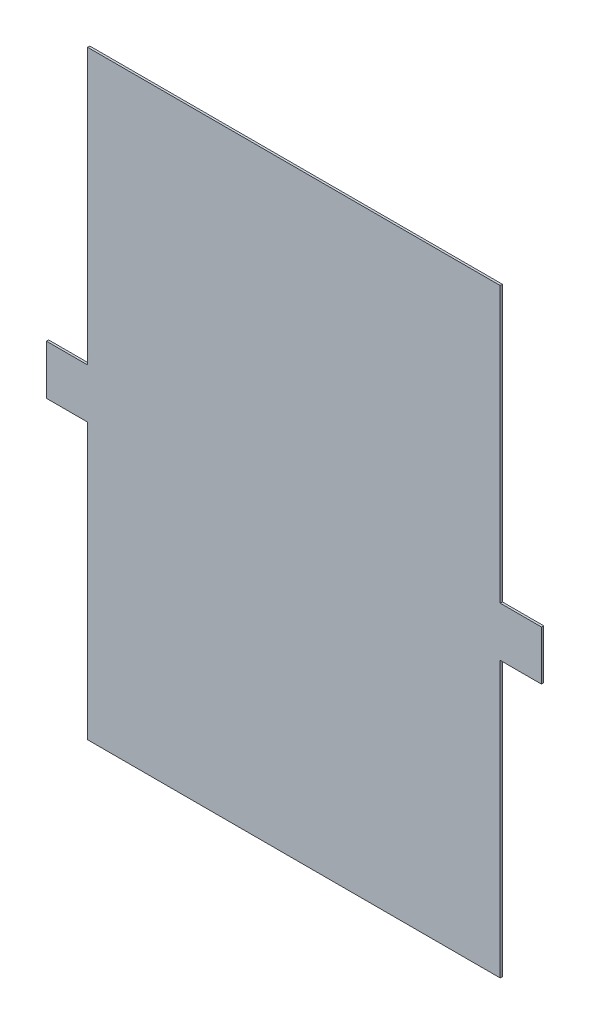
from build123d import *

# Parameters (mm, degrees)
BOSS_EXTRUDE1_DEPTH = 2.032


with BuildPart() as part:
    # Sketch1 → Boss-Extrude1 (new body)
    with BuildSketch(Plane.XY):
        Polygon((129.431914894, 13.960992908), (167.531914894, 13.960992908), (167.531914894, -31.759007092), (129.431914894, -31.759007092), (129.431914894, -285.759007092), (-251.568085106, -285.759007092), (-251.568085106, -31.759007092), (-289.668085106, -31.759007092), (-289.668085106, 13.960992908), (-251.568085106, 13.960992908), (-251.568085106, 267.960992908), (129.431914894, 267.960992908), align=None)
    extrude(amount=BOSS_EXTRUDE1_DEPTH)


solid = part.part
